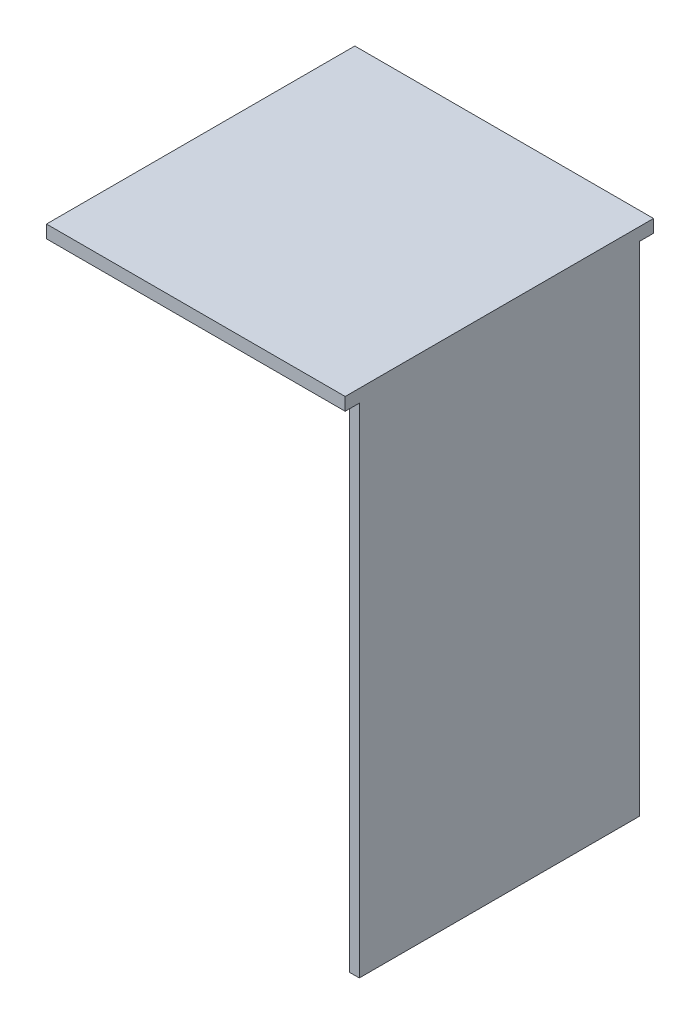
from build123d import *

# Parameters (mm, degrees)
SKETCH1_W           = 48
SKETCH1_H           = 48
BOSS_EXTRUDE1_DEPTH = 2
SKETCH2_W           = 1.5
SKETCH2_H           = 43.6
BOSS_EXTRUDE2_DEPTH = 79.5
SKETCH3_W           = 1.5
SKETCH3_H           = 48
CUT_EXTRUDE1_DEPTH  = 79.5


with BuildPart() as part:
    # Sketch1 → Boss-Extrude1 (new body)
    with BuildSketch(Plane(origin=(0, 0, 0), x_dir=(1, 0, 0), z_dir=(0, 1, 0))):
        Rectangle(SKETCH1_W, SKETCH1_H)
    extrude(amount=BOSS_EXTRUDE1_DEPTH)

    # Sketch2 → Boss-Extrude2 (add)
    with BuildSketch(Plane(origin=(0, 2, 0), x_dir=(1, 0, 0), z_dir=(0, 1, 0))):
        with Locations((21.75, 0)):
            Rectangle(SKETCH2_W, SKETCH2_H)
    extrude(amount=-BOSS_EXTRUDE2_DEPTH)

    # Sketch3 → Cut-Extrude1 (cut)
    with BuildSketch(Plane.XZ):
        with Locations((23.25, 0)):
            Rectangle(SKETCH3_W, SKETCH3_H)
    extrude(amount=-CUT_EXTRUDE1_DEPTH, mode=Mode.SUBTRACT)


solid = part.part
